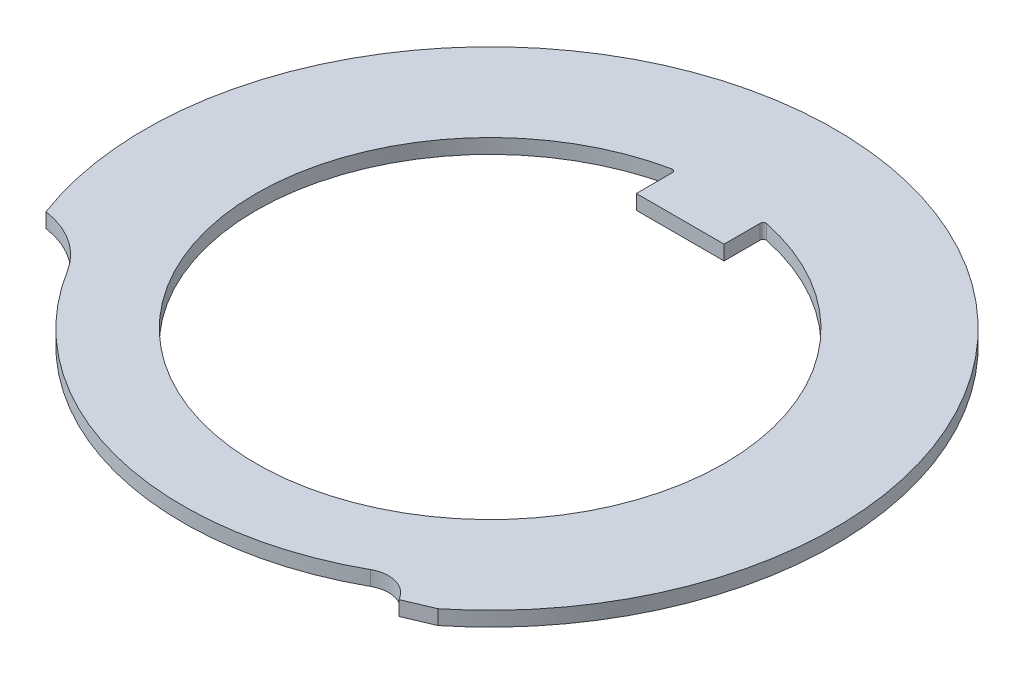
from build123d import *

# Parameters (mm, degrees)
BOSS_EXTRUDE1_DEPTH = 0.5
FILLET1_R           = 0.1


with BuildPart() as part:
    # Sketch1 → Boss-Extrude1 (new body)
    with BuildSketch(Plane(origin=(0, 0, 0), x_dir=(1, 0, 0), z_dir=(0, 1, 0))):
        with BuildLine():
            Line((7.405833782, -9.18660035), (6.465631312, -9.585692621))
            ThreePointArc((6.465631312, -9.585692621), (5.866379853, -9.095515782), (5.096810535, -9.180006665))
            ThreePointArc((5.096810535, -9.180006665), (-2.64863632, -10.160449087), (-8.929748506, -5.523548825))
            ThreePointArc((-8.929748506, -5.523548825), (-9.83687626, -4.59242065), (-11.052731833, -4.132447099))
            ThreePointArc((-11.052731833, -4.132447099), (3.116261, 11.381077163), (7.405833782, -9.18660035))
        make_face()
        with BuildLine():
            Line((-1.5, 6.5), (1.5, 6.5))
            Line((1.5, 6.5), (1.5, 7.858116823))
            ThreePointArc((1.5, 7.858116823), (0, -8), (-1.5, 7.858116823))
            Line((-1.5, 7.858116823), (-1.5, 6.5))
        make_face(mode=Mode.SUBTRACT)
    extrude(amount=BOSS_EXTRUDE1_DEPTH)

    # Fillet1
    fillet1_edges = [part.edges().sort_by_distance(p)[0] for p in [
        (-1.5, 0.25, -7.858116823),
        (1.5, 0.25, -7.858116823),
    ]]
    fillet(fillet1_edges, radius=FILLET1_R)


solid = part.part
